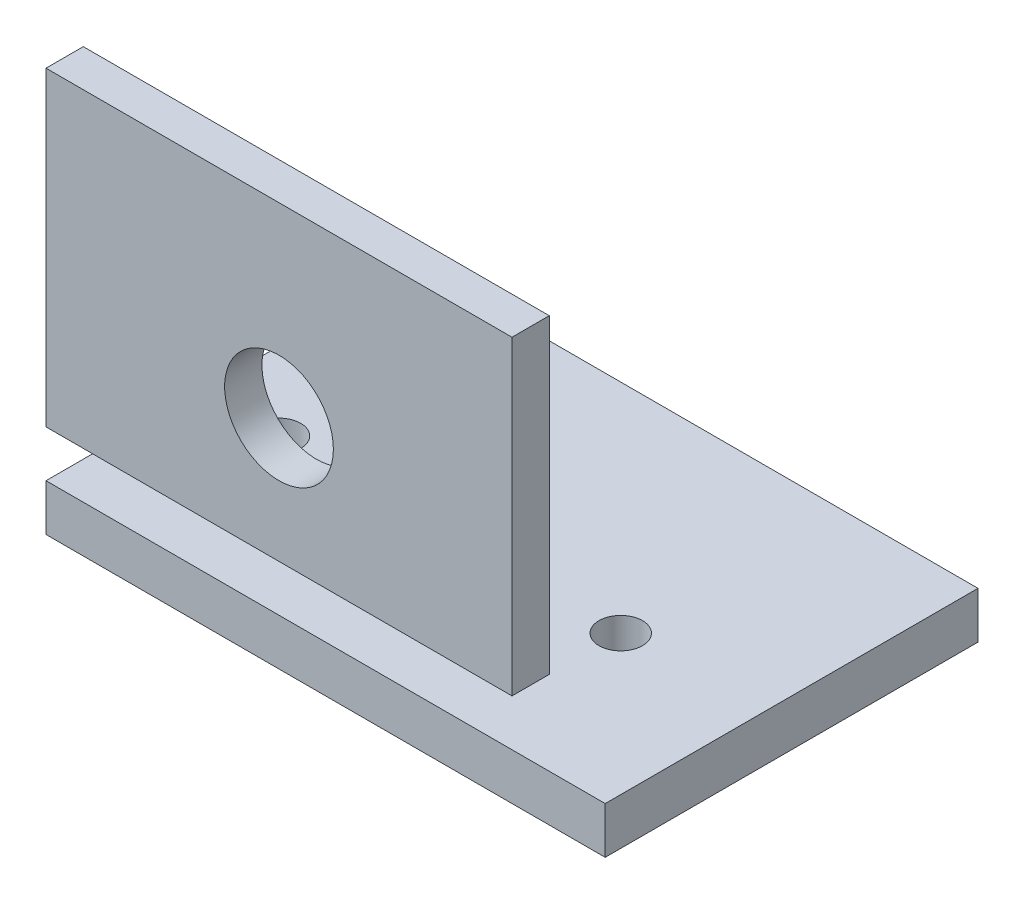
from build123d import *

# Parameters (mm, degrees)
SKETCH_1_W          = 180
SKETCH_1_H          = 120
EXTRUDE_1_DEPTH     = 15
SKETCH_2_R          = 7
CUT_EXTRUDE_1_DEPTH = 15
SKETCH_3_W          = 150
SKETCH_3_H          = 100
EXTRUDE_2_DEPTH     = 12
SKETCH_4_R          = 17.5
CUT_EXTRUDE_2_DEPTH = 12


with BuildPart() as part:
    # Sketch 1 → Extrude 1 (new body)
    with BuildSketch(Plane(origin=(0, 0, 0), x_dir=(1, 0, 0), z_dir=(0, 1, 0))):
        with Locations((90, 60)):
            Rectangle(SKETCH_1_W, SKETCH_1_H)
    extrude(amount=-EXTRUDE_1_DEPTH)

    # Sketch 2 → Cut-Extrude 1 (cut)
    with BuildSketch(Plane(origin=(0, 0, 0), x_dir=(1, 0, 0), z_dir=(0, 1, 0))):
        with Locations(Location((25, 50, 0), (0, 0, 270))):
            Circle(SKETCH_2_R)
        with Locations(Location((135, 50, 0), (0, 0, 270))):
            Circle(SKETCH_2_R)
    extrude(amount=-CUT_EXTRUDE_1_DEPTH, mode=Mode.SUBTRACT)


with BuildPart() as body_2:
    # Sketch 3 → Extrude 2 (new body)
    with BuildSketch(Plane.XY):
        with Locations((75, 65)):
            Rectangle(SKETCH_3_W, SKETCH_3_H)
    extrude(amount=-EXTRUDE_2_DEPTH)

    # Sketch 4 → Cut-Extrude 2 (cut)
    with BuildSketch(Plane.XY):
        with Locations((75, 55)):
            Circle(SKETCH_4_R)
    extrude(amount=-CUT_EXTRUDE_2_DEPTH, mode=Mode.SUBTRACT)


solid = Compound([part.part, body_2.part])
